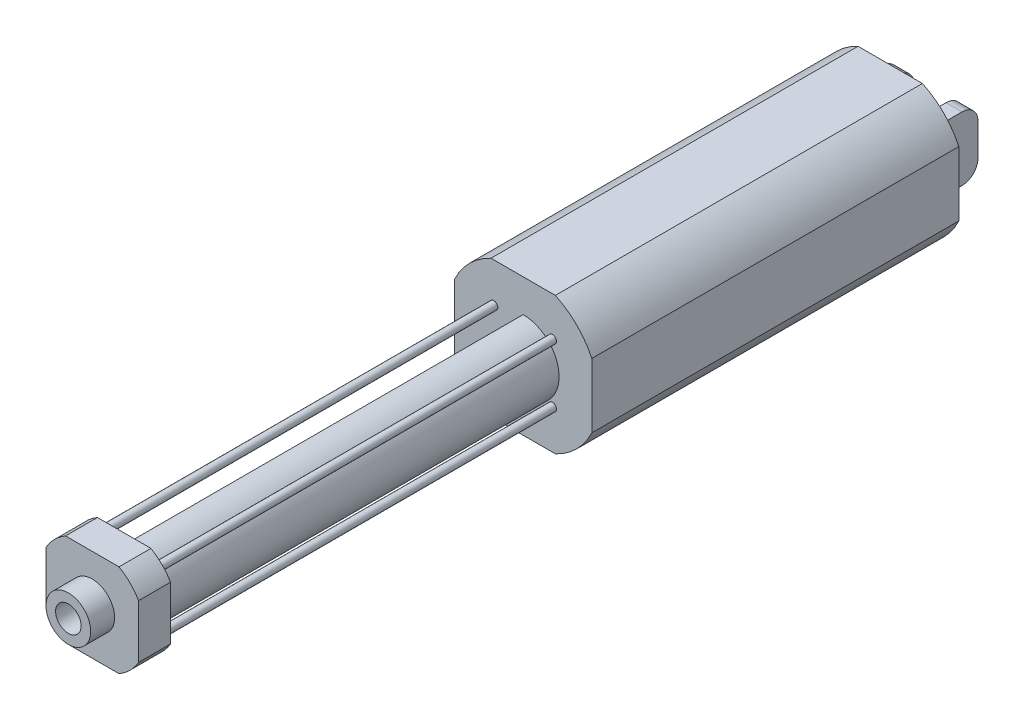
from build123d import *

# Parameters (mm, degrees)
BASE_EXTRUSION_DEPTH         = 230
BOSS_EXTRU_1_DEPTH           = 250
ESQUISSE3_W                  = 10
ESQUISSE3_H                  = 40
BOSS_EXTRU_2_DEPTH           = 30
ESQUISSE4_R                  = 6
BOSS_EXTRU_3_DEPTH           = 50
CONG_1_R                     = 10
BOSS_EXTRU_4_DEPTH           = 20
BOSS_EXTRU_5_START           = -270
ESQUISSE7_R                  = 2.5
BOSS_EXTRU_5_DEPTH           = 250
R_P_TITION_CIRCULAIRE1_COUNT = 4
ESQUISSE8_R                  = 14
BOSS_EXTRU_6_DEPTH           = 15
ENL_V_MAT_EXTRU_2_REACH      = 560.406
ESQUISSE9_R                  = 8


with BuildPart() as part:
    # Esquisse1 → Base-Extrusion (new body)
    with BuildSketch(Plane.XY):
        with BuildLine():
            Line((22.819563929, 86), (63.180436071, 86))
            ThreePointArc((63.180436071, 86), (76.587572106, 76.587572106), (86, 63.180436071))
            Line((86, 63.180436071), (86, 22.819563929))
            ThreePointArc((86, 22.819563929), (76.587572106, 9.412427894), (63.180436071, 0))
            Line((63.180436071, 0), (22.819563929, 0))
            ThreePointArc((22.819563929, 0), (9.412427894, 9.412427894), (0, 22.819563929))
            Line((0, 22.819563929), (0, 63.180436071))
            ThreePointArc((0, 63.180436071), (9.412427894, 76.587572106), (22.819563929, 86))
        make_face()
    extrude(amount=BASE_EXTRUSION_DEPTH)

    # Esquisse2 → Boss.-Extru.1 (add)
    with BuildSketch(Plane.XY.offset(230)):
        with BuildLine():
            Line((43, 65.5), (43, 63))
            ThreePointArc((43, 63), (57.142135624, 28.857864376), (23, 43))
            Line((23, 43), (20.5, 43))
            ThreePointArc((20.5, 43), (58.909902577, 27.090097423), (43, 65.5))
        make_face()
    extrude(amount=BOSS_EXTRU_1_DEPTH)

    # Esquisse3 → Boss.-Extru.2 (add)
    with BuildSketch(Plane(origin=(0, 0, 0), x_dir=(-1, 0, 0), z_dir=(0, 0, -1))):
        with Locations((-63, 43)):
            Rectangle(ESQUISSE3_W, ESQUISSE3_H)
        with Locations((-23, 43)):
            Rectangle(ESQUISSE3_W, ESQUISSE3_H)
    extrude(amount=BOSS_EXTRU_2_DEPTH)

    # Esquisse4 → Boss.-Extru.3 (add)
    with BuildSketch(Plane.ZY.offset(-18)):
        with Locations(Location((-15, 43, 0), (0, 0, 270))):
            Circle(ESQUISSE4_R)
    extrude(amount=-BOSS_EXTRU_3_DEPTH)

    # Cong_1
    cong_1_edges = [part.edges().sort_by_distance(p)[0] for p in [
        (63, 23, -30),
        (63, 63, -30),
        (23, 63, -30),
        (23, 23, -30),
    ]]
    fillet(cong_1_edges, radius=CONG_1_R)

    # Esquisse6 → Boss.-Extru.4 (add)
    with BuildSketch(Plane.XY.offset(480)):
        with BuildLine():
            Line((26.229490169, 14), (59.770509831, 14))
            ThreePointArc((59.770509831, 14), (66.68807717, 19.31192283), (72, 26.229490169))
            Line((72, 26.229490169), (72, 59.770509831))
            ThreePointArc((72, 59.770509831), (66.68807717, 66.68807717), (59.770509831, 72))
            Line((59.770509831, 72), (26.229490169, 72))
            ThreePointArc((26.229490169, 72), (19.31192283, 66.68807717), (14, 59.770509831))
            Line((14, 59.770509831), (14, 26.229490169))
            ThreePointArc((14, 26.229490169), (19.31192283, 19.31192283), (26.229490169, 14))
        make_face()
    extrude(amount=BOSS_EXTRU_4_DEPTH)

    # Esquisse7 → Boss.-Extru.5 (add)
    with BuildSketch(Plane.XY.offset(500).offset(BOSS_EXTRU_5_START)):
        with Locations((24.615223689, 61.384776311)):
            Circle(ESQUISSE7_R)
    boss_extru_5 = extrude(amount=BOSS_EXTRU_5_DEPTH)

    # R_p_tition circulaire1: Boss.-Extru.5 ×4 about axis
    r_p_tition_circulaire1_axis = Axis((43, 43, 0), (0, 0, 1))
    for i in range(1, R_P_TITION_CIRCULAIRE1_COUNT):
        add(boss_extru_5.rotate(r_p_tition_circulaire1_axis, i * 360 / R_P_TITION_CIRCULAIRE1_COUNT))

    # Esquisse8 → Boss.-Extru.6 (add)
    with BuildSketch(Plane.XY.offset(500)):
        with Locations((43, 43)):
            Circle(ESQUISSE8_R)
    extrude(amount=BOSS_EXTRU_6_DEPTH)

    # Esquisse9 → Enl_v. mat.-Extru.2 (cut, up to next)
    with BuildSketch(Plane.XY.offset(515), mode=Mode.PRIVATE) as enl_v_mat_extru_2_sk1:
        with Locations((43, 43)):
            Circle(ESQUISSE9_R)
    enl_v_mat_extru_2_tool1 = extrude(enl_v_mat_extru_2_sk1.sketch, amount=-ENL_V_MAT_EXTRU_2_REACH, mode=Mode.PRIVATE) & part.part
    add(enl_v_mat_extru_2_tool1.solids().sort_by_distance((43, 43, 515))[0], mode=Mode.SUBTRACT)


solid = part.part
